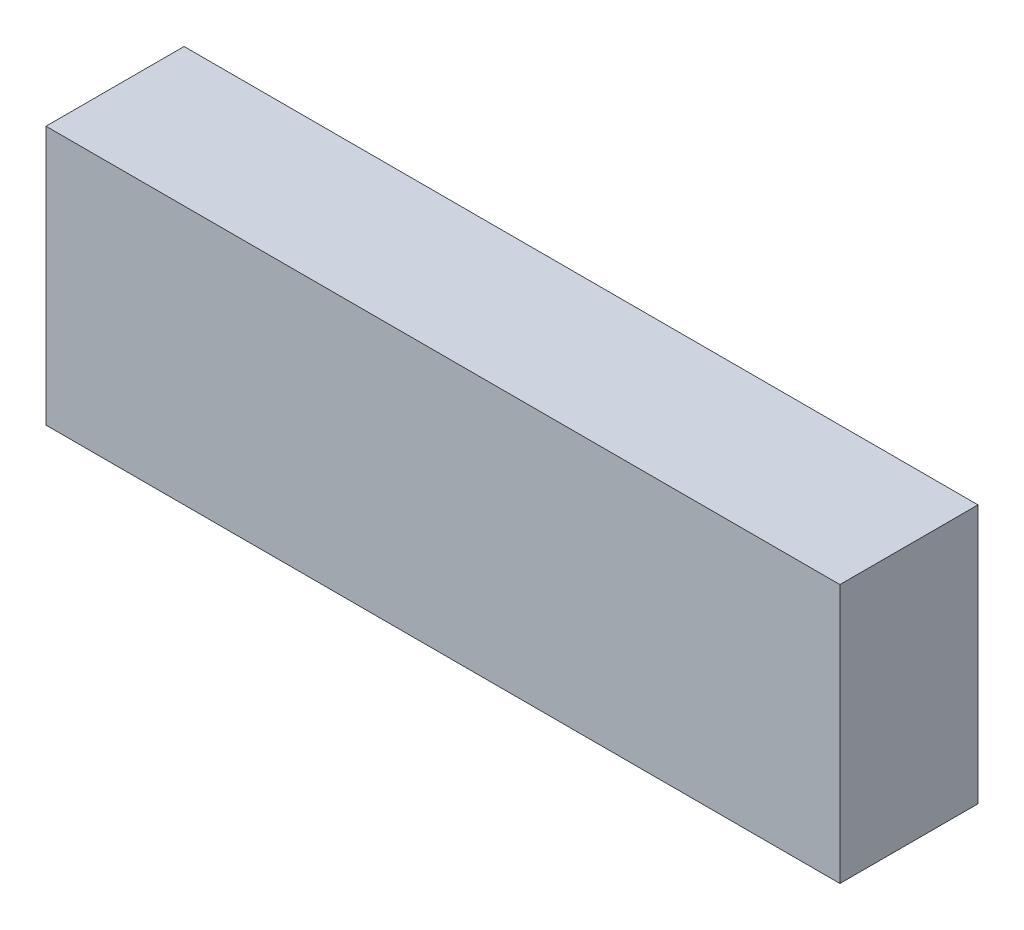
from build123d import *

# Parameters (mm, degrees)
SKETCH1_W           = 230
SKETCH1_H           = 40
BOSS_EXTRUDE1_DEPTH = 37.5


with BuildPart() as part:
    # Sketch1 → Boss-Extrude1 (new, symmetric)
    with BuildSketch(Plane(origin=(0, 0, 0), x_dir=(1, 0, 0), z_dir=(0, 1, 0))):
        Rectangle(SKETCH1_W, SKETCH1_H)
    extrude(amount=BOSS_EXTRUDE1_DEPTH, both=True)


solid = part.part
